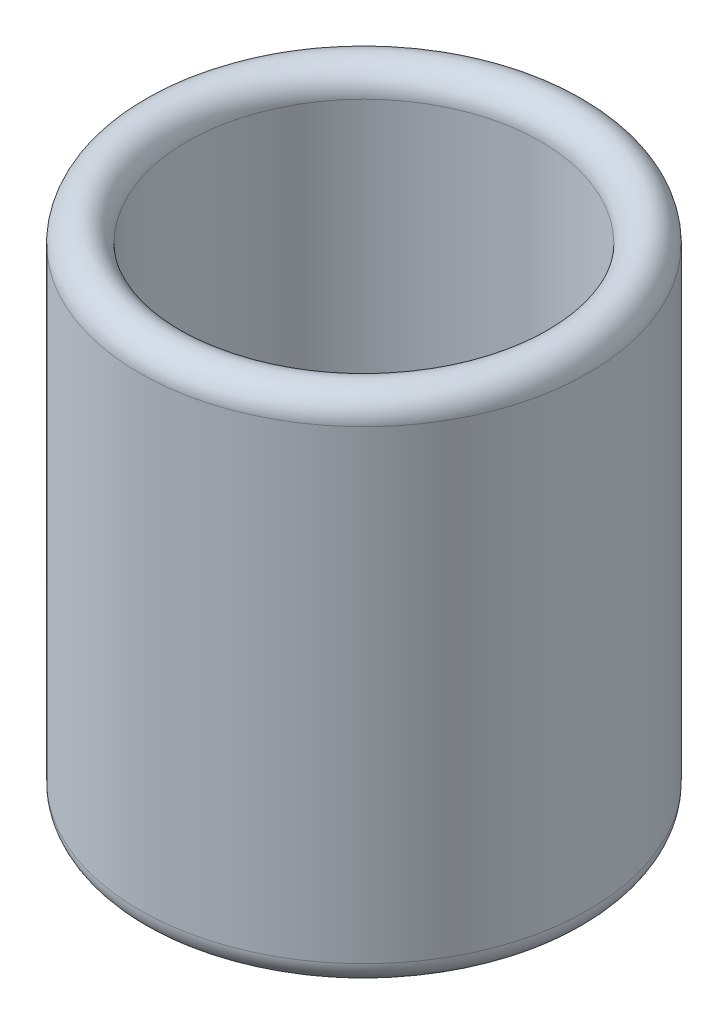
ISO-10303-21;
HEADER;
FILE_DESCRIPTION(('STEP AP214'),'2;1');
FILE_NAME('part.step','',(''),(''),'','','');
FILE_SCHEMA(('AUTOMOTIVE_DESIGN { 1 0 10303 214 1 1 1 1 }'));
ENDSEC;
DATA;
#1=APPLICATION_CONTEXT('core data for automotive mechanical design processes');
#2=APPLICATION_PROTOCOL_DEFINITION('international standard','automotive_design',2000,#1);
#3=PRODUCT_CONTEXT('',#1,'mechanical');
#4=PRODUCT('Part','Part','',(#3));
#5=PRODUCT_RELATED_PRODUCT_CATEGORY('part','',(#4));
#6=PRODUCT_DEFINITION_FORMATION('','',#4);
#7=PRODUCT_DEFINITION_CONTEXT('part definition',#1,'design');
#8=PRODUCT_DEFINITION('design','',#6,#7);
#9=PRODUCT_DEFINITION_SHAPE('','',#8);
#10=(LENGTH_UNIT() NAMED_UNIT(*) SI_UNIT(.MILLI.,.METRE.));
#11=(NAMED_UNIT(*) PLANE_ANGLE_UNIT() SI_UNIT($,.RADIAN.));
#12=(NAMED_UNIT(*) SI_UNIT($,.STERADIAN.) SOLID_ANGLE_UNIT());
#13=UNCERTAINTY_MEASURE_WITH_UNIT(LENGTH_MEASURE(1.E-05),#10,'distance_accuracy_value','');
#14=(GEOMETRIC_REPRESENTATION_CONTEXT(3) GLOBAL_UNCERTAINTY_ASSIGNED_CONTEXT((#13)) GLOBAL_UNIT_ASSIGNED_CONTEXT((#10,
#11,#12)) REPRESENTATION_CONTEXT('',''));
#15=CARTESIAN_POINT('',(0.,0.,0.));
#16=DIRECTION('',(0.,0.,1.));
#17=DIRECTION('',(1.,0.,0.));
#18=AXIS2_PLACEMENT_3D('',#15,#16,#17);
#19=CARTESIAN_POINT('',(0.,0.127,0.));
#20=DIRECTION('',(0.,1.,0.));
#21=DIRECTION('',(0.,0.,1.));
#22=AXIS2_PLACEMENT_3D('',#19,#20,#21);
#23=TOROIDAL_SURFACE('',#22,1.068,0.127);
#24=CARTESIAN_POINT('',(0.,0.127,0.));
#25=DIRECTION('',(0.,1.,0.));
#26=DIRECTION('',(0.,0.,1.));
#27=AXIS2_PLACEMENT_3D('',#24,#25,#26);
#28=CIRCLE('',#27,0.941);
#29=CARTESIAN_POINT('',(0.,0.127,-0.941));
#30=VERTEX_POINT('',#29);
#31=EDGE_CURVE('E41',#30,#30,#28,.F.);
#32=ORIENTED_EDGE('',*,*,#31,.F.);
#33=EDGE_LOOP('',(#32));
#34=FACE_BOUND('',#33,.T.);
#35=CARTESIAN_POINT('',(0.,0.127,0.));
#36=DIRECTION('',(0.,1.,0.));
#37=DIRECTION('',(0.,0.,1.));
#38=AXIS2_PLACEMENT_3D('',#35,#36,#37);
#39=CIRCLE('',#38,1.195);
#40=CARTESIAN_POINT('',(0.,0.127,-1.195));
#41=VERTEX_POINT('',#40);
#42=EDGE_CURVE('E10',#41,#41,#39,.T.);
#43=ORIENTED_EDGE('',*,*,#42,.F.);
#44=EDGE_LOOP('',(#43));
#45=FACE_BOUND('',#44,.T.);
#46=ADVANCED_FACE('F34',(#34,#45),#23,.T.);
#47=CARTESIAN_POINT('',(0.,2.603,0.));
#48=DIRECTION('',(0.,1.,0.));
#49=DIRECTION('',(0.,0.,1.));
#50=AXIS2_PLACEMENT_3D('',#47,#48,#49);
#51=TOROIDAL_SURFACE('',#50,1.068,0.127);
#52=CARTESIAN_POINT('',(0.,2.603,0.));
#53=DIRECTION('',(0.,1.,0.));
#54=DIRECTION('',(0.,0.,1.));
#55=AXIS2_PLACEMENT_3D('',#52,#53,#54);
#56=CIRCLE('',#55,1.195);
#57=CARTESIAN_POINT('',(0.,2.603,-1.195));
#58=VERTEX_POINT('',#57);
#59=EDGE_CURVE('E49',#58,#58,#56,.F.);
#60=ORIENTED_EDGE('',*,*,#59,.F.);
#61=EDGE_LOOP('',(#60));
#62=FACE_BOUND('',#61,.T.);
#63=CARTESIAN_POINT('',(0.,2.603,0.));
#64=DIRECTION('',(0.,1.,0.));
#65=DIRECTION('',(0.,0.,1.));
#66=AXIS2_PLACEMENT_3D('',#63,#64,#65);
#67=CIRCLE('',#66,0.941);
#68=CARTESIAN_POINT('',(0.,2.603,-0.941));
#69=VERTEX_POINT('',#68);
#70=EDGE_CURVE('E45',#69,#69,#67,.T.);
#71=ORIENTED_EDGE('',*,*,#70,.F.);
#72=EDGE_LOOP('',(#71));
#73=FACE_BOUND('',#72,.T.);
#74=ADVANCED_FACE('F57',(#62,#73),#51,.T.);
#75=CARTESIAN_POINT('',(0.,2.73,0.));
#76=DIRECTION('',(0.,-1.,0.));
#77=DIRECTION('',(0.,0.,-1.));
#78=AXIS2_PLACEMENT_3D('',#75,#76,#77);
#79=CYLINDRICAL_SURFACE('',#78,1.195);
#80=CARTESIAN_POINT('',(0.,0.127,-1.195));
#81=CARTESIAN_POINT('',(0.,0.152791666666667,-1.195));
#82=CARTESIAN_POINT('',(0.,0.178583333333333,-1.195));
#83=CARTESIAN_POINT('',(0.,0.230166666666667,-1.195));
#84=CARTESIAN_POINT('',(0.,0.255958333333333,-1.195));
#85=CARTESIAN_POINT('',(0.,0.307541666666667,-1.195));
#86=CARTESIAN_POINT('',(0.,0.333333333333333,-1.195));
#87=CARTESIAN_POINT('',(0.,0.384916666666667,-1.195));
#88=CARTESIAN_POINT('',(0.,0.410708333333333,-1.195));
#89=CARTESIAN_POINT('',(0.,0.462291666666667,-1.195));
#90=CARTESIAN_POINT('',(0.,0.488083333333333,-1.195));
#91=CARTESIAN_POINT('',(0.,0.539666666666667,-1.195));
#92=CARTESIAN_POINT('',(0.,0.565458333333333,-1.195));
#93=CARTESIAN_POINT('',(0.,0.617041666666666,-1.195));
#94=CARTESIAN_POINT('',(0.,0.642833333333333,-1.195));
#95=CARTESIAN_POINT('',(0.,0.694416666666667,-1.195));
#96=CARTESIAN_POINT('',(0.,0.720208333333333,-1.195));
#97=CARTESIAN_POINT('',(0.,0.771791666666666,-1.195));
#98=CARTESIAN_POINT('',(0.,0.797583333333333,-1.195));
#99=CARTESIAN_POINT('',(0.,0.849166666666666,-1.195));
#100=CARTESIAN_POINT('',(0.,0.874958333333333,-1.195));
#101=CARTESIAN_POINT('',(0.,0.926541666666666,-1.195));
#102=CARTESIAN_POINT('',(0.,0.952333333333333,-1.195));
#103=CARTESIAN_POINT('',(0.,1.00391666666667,-1.195));
#104=CARTESIAN_POINT('',(0.,1.02970833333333,-1.195));
#105=CARTESIAN_POINT('',(0.,1.08129166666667,-1.195));
#106=CARTESIAN_POINT('',(0.,1.10708333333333,-1.195));
#107=CARTESIAN_POINT('',(0.,1.15866666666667,-1.195));
#108=CARTESIAN_POINT('',(0.,1.18445833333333,-1.195));
#109=CARTESIAN_POINT('',(0.,1.23604166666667,-1.195));
#110=CARTESIAN_POINT('',(0.,1.26183333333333,-1.195));
#111=CARTESIAN_POINT('',(0.,1.31341666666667,-1.195));
#112=CARTESIAN_POINT('',(0.,1.33920833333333,-1.195));
#113=CARTESIAN_POINT('',(0.,1.39079166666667,-1.195));
#114=CARTESIAN_POINT('',(0.,1.41658333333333,-1.195));
#115=CARTESIAN_POINT('',(0.,1.46816666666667,-1.195));
#116=CARTESIAN_POINT('',(0.,1.49395833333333,-1.195));
#117=CARTESIAN_POINT('',(0.,1.54554166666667,-1.195));
#118=CARTESIAN_POINT('',(0.,1.57133333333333,-1.195));
#119=CARTESIAN_POINT('',(0.,1.62291666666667,-1.195));
#120=CARTESIAN_POINT('',(0.,1.64870833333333,-1.195));
#121=CARTESIAN_POINT('',(0.,1.70029166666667,-1.195));
#122=CARTESIAN_POINT('',(0.,1.72608333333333,-1.195));
#123=CARTESIAN_POINT('',(0.,1.77766666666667,-1.195));
#124=CARTESIAN_POINT('',(0.,1.80345833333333,-1.195));
#125=CARTESIAN_POINT('',(0.,1.85504166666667,-1.195));
#126=CARTESIAN_POINT('',(0.,1.88083333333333,-1.195));
#127=CARTESIAN_POINT('',(0.,1.93241666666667,-1.195));
#128=CARTESIAN_POINT('',(0.,1.95820833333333,-1.195));
#129=CARTESIAN_POINT('',(0.,2.00979166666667,-1.195));
#130=CARTESIAN_POINT('',(0.,2.03558333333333,-1.195));
#131=CARTESIAN_POINT('',(0.,2.08716666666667,-1.195));
#132=CARTESIAN_POINT('',(0.,2.11295833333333,-1.195));
#133=CARTESIAN_POINT('',(0.,2.16454166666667,-1.195));
#134=CARTESIAN_POINT('',(0.,2.19033333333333,-1.195));
#135=CARTESIAN_POINT('',(0.,2.24191666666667,-1.195));
#136=CARTESIAN_POINT('',(0.,2.26770833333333,-1.195));
#137=CARTESIAN_POINT('',(0.,2.31929166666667,-1.195));
#138=CARTESIAN_POINT('',(0.,2.34508333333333,-1.195));
#139=CARTESIAN_POINT('',(0.,2.39666666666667,-1.195));
#140=CARTESIAN_POINT('',(0.,2.42245833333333,-1.195));
#141=CARTESIAN_POINT('',(0.,2.47404166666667,-1.195));
#142=CARTESIAN_POINT('',(0.,2.49983333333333,-1.195));
#143=CARTESIAN_POINT('',(0.,2.55141666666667,-1.195));
#144=CARTESIAN_POINT('',(0.,2.57720833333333,-1.195));
#145=CARTESIAN_POINT('',(0.,2.603,-1.195));
#146=B_SPLINE_CURVE_WITH_KNOTS('',3,(#80,#81,#82,#83,#84,#85,#86,#87,#88,#89,#90,#91,#92,#93,
#94,#95,#96,#97,#98,#99,#100,#101,#102,#103,#104,#105,#106,#107,#108,#109,#110,#111,#112,#113,
#114,#115,#116,#117,#118,#119,#120,#121,#122,#123,#124,#125,#126,#127,#128,#129,#130,#131,#132,
#133,#134,#135,#136,#137,#138,#139,#140,#141,#142,#143,#144,#145),.UNSPECIFIED.,.F.,.F.,(4,2,2,
2,2,2,2,2,2,2,2,2,2,2,2,2,2,2,2,2,2,2,2,2,2,2,2,2,2,2,2,2,4),(0.,0.0773750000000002,0.15475,
0.232125,0.3095,0.386875,0.46425,0.541625,0.619,0.696375,0.77375,0.851125,0.9285,1.005875,
1.08325,1.160625,1.238,1.315375,1.39275,1.470125,1.5475,1.624875,1.70225,1.779625,1.857,
1.934375,2.01175,2.089125,2.1665,2.243875,2.32125,2.398625,2.476),.UNSPECIFIED.);
#147=EDGE_CURVE('BSEAM55',#41,#58,#146,.T.);
#148=ORIENTED_EDGE('',*,*,#42,.T.);
#149=ORIENTED_EDGE('',*,*,#59,.T.);
#150=ORIENTED_EDGE('',*,*,#147,.T.);
#151=ORIENTED_EDGE('',*,*,#147,.F.);
#152=EDGE_LOOP('',(#148,#150,#149,#151));
#153=FACE_BOUND('',#152,.T.);
#154=ADVANCED_FACE('F55',(#153),#79,.T.);
#155=CARTESIAN_POINT('',(0.,2.73,0.));
#156=DIRECTION('',(0.,-1.,0.));
#157=DIRECTION('',(0.,0.,-1.));
#158=AXIS2_PLACEMENT_3D('',#155,#156,#157);
#159=CYLINDRICAL_SURFACE('',#158,0.941);
#160=CARTESIAN_POINT('',(0.,0.127,-0.941));
#161=CARTESIAN_POINT('',(0.,0.152791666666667,-0.941));
#162=CARTESIAN_POINT('',(0.,0.178583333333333,-0.941));
#163=CARTESIAN_POINT('',(0.,0.230166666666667,-0.941));
#164=CARTESIAN_POINT('',(0.,0.255958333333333,-0.941));
#165=CARTESIAN_POINT('',(0.,0.307541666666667,-0.941));
#166=CARTESIAN_POINT('',(0.,0.333333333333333,-0.941));
#167=CARTESIAN_POINT('',(0.,0.384916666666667,-0.941));
#168=CARTESIAN_POINT('',(0.,0.410708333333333,-0.941));
#169=CARTESIAN_POINT('',(0.,0.462291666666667,-0.941));
#170=CARTESIAN_POINT('',(0.,0.488083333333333,-0.941));
#171=CARTESIAN_POINT('',(0.,0.539666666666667,-0.941));
#172=CARTESIAN_POINT('',(0.,0.565458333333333,-0.941));
#173=CARTESIAN_POINT('',(0.,0.617041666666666,-0.941));
#174=CARTESIAN_POINT('',(0.,0.642833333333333,-0.941));
#175=CARTESIAN_POINT('',(0.,0.694416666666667,-0.941));
#176=CARTESIAN_POINT('',(0.,0.720208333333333,-0.941));
#177=CARTESIAN_POINT('',(0.,0.771791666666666,-0.941));
#178=CARTESIAN_POINT('',(0.,0.797583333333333,-0.941));
#179=CARTESIAN_POINT('',(0.,0.849166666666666,-0.941));
#180=CARTESIAN_POINT('',(0.,0.874958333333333,-0.941));
#181=CARTESIAN_POINT('',(0.,0.926541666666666,-0.941));
#182=CARTESIAN_POINT('',(0.,0.952333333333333,-0.941));
#183=CARTESIAN_POINT('',(0.,1.00391666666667,-0.941));
#184=CARTESIAN_POINT('',(0.,1.02970833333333,-0.941));
#185=CARTESIAN_POINT('',(0.,1.08129166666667,-0.941));
#186=CARTESIAN_POINT('',(0.,1.10708333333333,-0.941));
#187=CARTESIAN_POINT('',(0.,1.15866666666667,-0.941));
#188=CARTESIAN_POINT('',(0.,1.18445833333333,-0.941));
#189=CARTESIAN_POINT('',(0.,1.23604166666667,-0.941));
#190=CARTESIAN_POINT('',(0.,1.26183333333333,-0.941));
#191=CARTESIAN_POINT('',(0.,1.31341666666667,-0.941));
#192=CARTESIAN_POINT('',(0.,1.33920833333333,-0.941));
#193=CARTESIAN_POINT('',(0.,1.39079166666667,-0.941));
#194=CARTESIAN_POINT('',(0.,1.41658333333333,-0.941));
#195=CARTESIAN_POINT('',(0.,1.46816666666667,-0.941));
#196=CARTESIAN_POINT('',(0.,1.49395833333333,-0.941));
#197=CARTESIAN_POINT('',(0.,1.54554166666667,-0.941));
#198=CARTESIAN_POINT('',(0.,1.57133333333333,-0.941));
#199=CARTESIAN_POINT('',(0.,1.62291666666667,-0.941));
#200=CARTESIAN_POINT('',(0.,1.64870833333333,-0.941));
#201=CARTESIAN_POINT('',(0.,1.70029166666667,-0.941));
#202=CARTESIAN_POINT('',(0.,1.72608333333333,-0.941));
#203=CARTESIAN_POINT('',(0.,1.77766666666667,-0.941));
#204=CARTESIAN_POINT('',(0.,1.80345833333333,-0.941));
#205=CARTESIAN_POINT('',(0.,1.85504166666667,-0.941));
#206=CARTESIAN_POINT('',(0.,1.88083333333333,-0.941));
#207=CARTESIAN_POINT('',(0.,1.93241666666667,-0.941));
#208=CARTESIAN_POINT('',(0.,1.95820833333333,-0.941));
#209=CARTESIAN_POINT('',(0.,2.00979166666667,-0.941));
#210=CARTESIAN_POINT('',(0.,2.03558333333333,-0.941));
#211=CARTESIAN_POINT('',(0.,2.08716666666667,-0.941));
#212=CARTESIAN_POINT('',(0.,2.11295833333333,-0.941));
#213=CARTESIAN_POINT('',(0.,2.16454166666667,-0.941));
#214=CARTESIAN_POINT('',(0.,2.19033333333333,-0.941));
#215=CARTESIAN_POINT('',(0.,2.24191666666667,-0.941));
#216=CARTESIAN_POINT('',(0.,2.26770833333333,-0.941));
#217=CARTESIAN_POINT('',(0.,2.31929166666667,-0.941));
#218=CARTESIAN_POINT('',(0.,2.34508333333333,-0.941));
#219=CARTESIAN_POINT('',(0.,2.39666666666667,-0.941));
#220=CARTESIAN_POINT('',(0.,2.42245833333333,-0.941));
#221=CARTESIAN_POINT('',(0.,2.47404166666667,-0.941));
#222=CARTESIAN_POINT('',(0.,2.49983333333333,-0.941));
#223=CARTESIAN_POINT('',(0.,2.55141666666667,-0.941));
#224=CARTESIAN_POINT('',(0.,2.57720833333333,-0.941));
#225=CARTESIAN_POINT('',(0.,2.603,-0.941));
#226=B_SPLINE_CURVE_WITH_KNOTS('',3,(#160,#161,#162,#163,#164,#165,#166,#167,#168,#169,#170,
#171,#172,#173,#174,#175,#176,#177,#178,#179,#180,#181,#182,#183,#184,#185,#186,#187,#188,#189,
#190,#191,#192,#193,#194,#195,#196,#197,#198,#199,#200,#201,#202,#203,#204,#205,#206,#207,#208,
#209,#210,#211,#212,#213,#214,#215,#216,#217,#218,#219,#220,#221,#222,#223,#224,#225),
.UNSPECIFIED.,.F.,.F.,(4,2,2,2,2,2,2,2,2,2,2,2,2,2,2,2,2,2,2,2,2,2,2,2,2,2,2,2,2,2,2,2,4),(0.,
0.0773750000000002,0.15475,0.232125,0.3095,0.386875,0.46425,0.541625,0.619,0.696375,0.77375,
0.851125,0.9285,1.005875,1.08325,1.160625,1.238,1.315375,1.39275,1.470125,1.5475,1.624875,
1.70225,1.779625,1.857,1.934375,2.01175,2.089125,2.1665,2.243875,2.32125,2.398625,2.476),.UNSPECIFIED.);
#227=EDGE_CURVE('BSEAM62',#30,#69,#226,.T.);
#228=ORIENTED_EDGE('',*,*,#31,.T.);
#229=ORIENTED_EDGE('',*,*,#70,.T.);
#230=ORIENTED_EDGE('',*,*,#227,.T.);
#231=ORIENTED_EDGE('',*,*,#227,.F.);
#232=EDGE_LOOP('',(#228,#230,#229,#231));
#233=FACE_BOUND('',#232,.T.);
#234=ADVANCED_FACE('F62',(#233),#159,.F.);
#235=CLOSED_SHELL('',(#46,#74,#154,#234));
#236=MANIFOLD_SOLID_BREP('B2',#235);
#237=ADVANCED_BREP_SHAPE_REPRESENTATION('',(#18,#236),#14);
#238=SHAPE_DEFINITION_REPRESENTATION(#9,#237);
ENDSEC;
END-ISO-10303-21;
